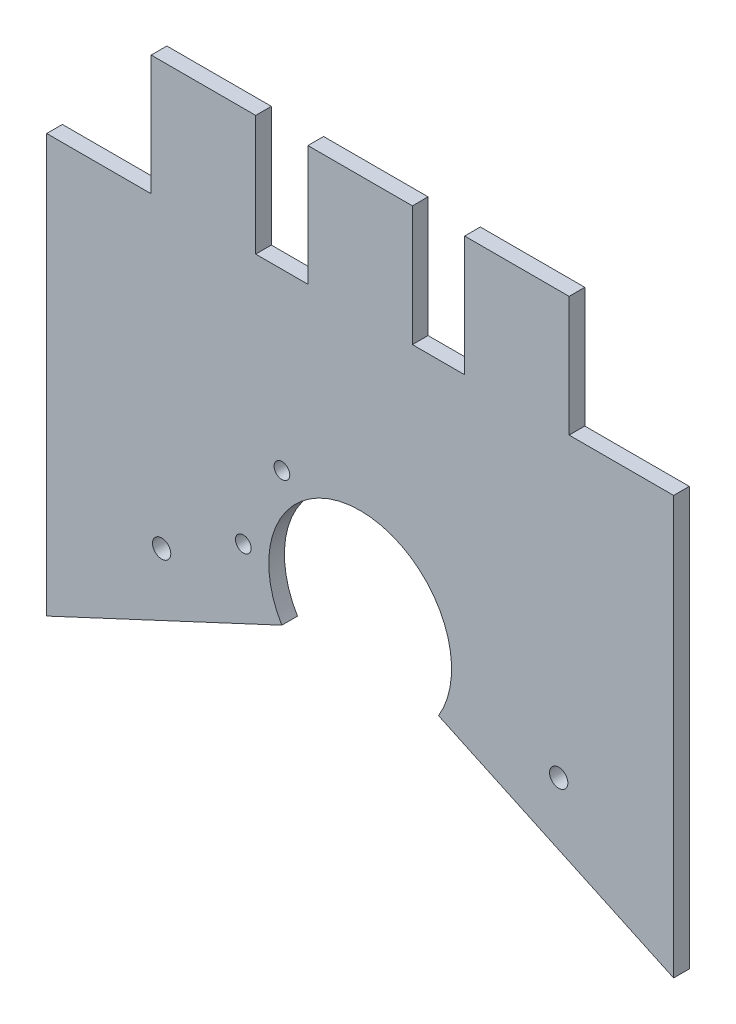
from build123d import *

# Parameters (mm, degrees)
ESQUISSE1_R        = 1.75
ESQUISSE1_R_2      = 1.5
BOSS_EXTRU_1_DEPTH = 3


with BuildPart() as part:
    # Esquisse1 → Boss.-Extru.1 (new body)
    # profile 1 of 2: a face of its own
    with BuildSketch(Plane.XY):
        with BuildLine():
            Line((0, 0), (-10, 0))
            Line((-10, 0), (-10, -23))
            Line((-10, -23), (-20, -23))
            Line((-20, -23), (-20, 0))
            Line((-20, 0), (-40, 0))
            Line((-40, 0), (-40, -23))
            Line((-40, -23), (-60, -23))
            Line((-60, -23), (-60, -80.8))
            Line((-60, -80.8), (-60, -103))
            Line((-60, -103), (-14.998930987, -82.015656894))
            ThreePointArc((-14.998930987, -82.015656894), (-15.231940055, -64.383852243), (0, -55.5))
            Line((0, -55.5), (0, 0))
        make_face()
        with Locations((-38, -80.8)):
            Circle(ESQUISSE1_R, mode=Mode.SUBTRACT)
        with Locations((-22.367850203, -72.224256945)):
            Circle(ESQUISSE1_R_2, mode=Mode.SUBTRACT)
        with Locations((-14.972030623, -56.363870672)):
            Circle(ESQUISSE1_R_2, mode=Mode.SUBTRACT)
    # profile 2 of 2: a face of its own
    with BuildSketch(Plane.XY):
        with BuildLine():
            Line((10, 0), (0, 0))
            Line((0, 0), (0, -55.5))
            ThreePointArc((0, -55.5), (15.231940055, -64.383852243), (14.998930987, -82.015656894))
            Line((14.998930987, -82.015656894), (60, -103))
            Line((60, -103), (60, -80.8))
            Line((60, -80.8), (60, -23))
            Line((60, -23), (40, -23))
            Line((40, -23), (40, 0))
            Line((40, 0), (20, 0))
            Line((20, 0), (20, -23))
            Line((20, -23), (10, -23))
            Line((10, -23), (10, 0))
        make_face()
        with Locations((38, -80.8)):
            Circle(ESQUISSE1_R, mode=Mode.SUBTRACT)
    extrude(amount=BOSS_EXTRU_1_DEPTH)


solid = part.part
